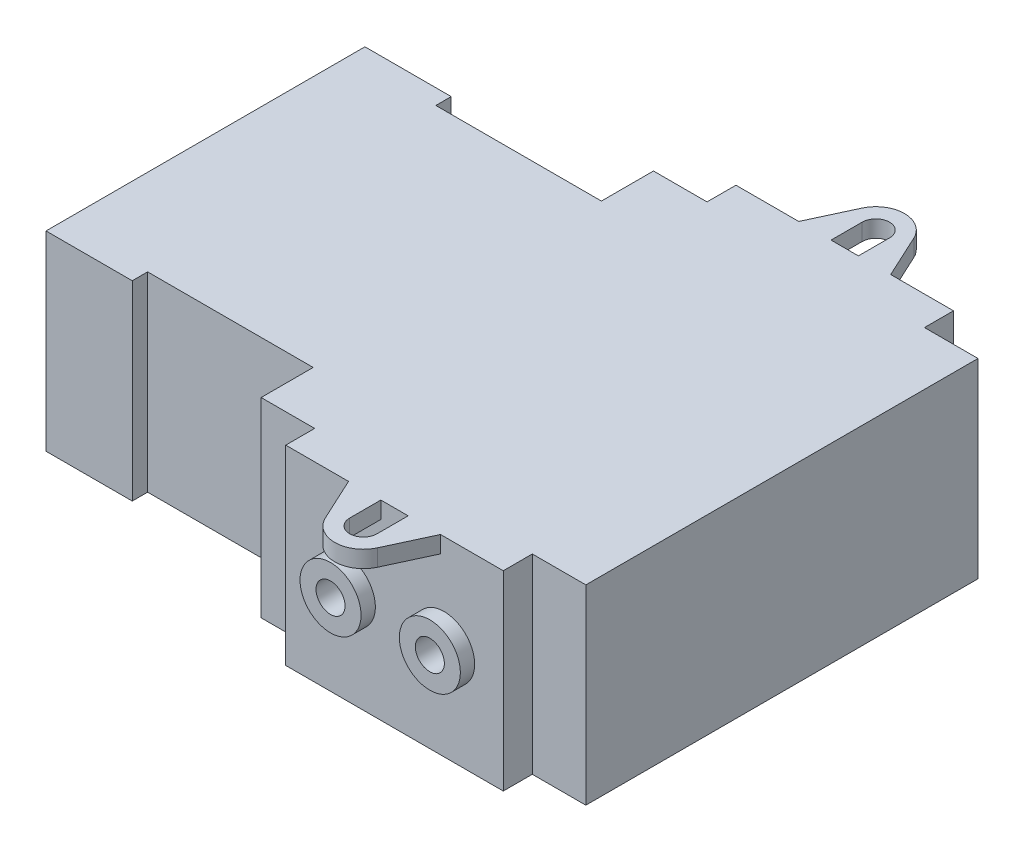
from build123d import *

# Parameters (mm, degrees)
BOSS_EXTRUDE1_DEPTH = 23.0378
SKETCH2_R           = 3.683
BOSS_EXTRUDE2_DEPTH = 1.7272
SKETCH3_R           = 1.7526
CUT_EXTRUDE1_DEPTH  = 72.299953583
BOSS_EXTRUDE3_DEPTH = 2.032


with BuildPart() as part:
    # Sketch1 → Boss-Extrude1 (new body)
    with BuildSketch(Plane(origin=(0, 0, 0), x_dir=(1, 0, 0), z_dir=(0, 1, 0))):
        Polygon((-34.798, 19.2532), (-24.384, 19.2532), (-24.384, 17.399), (-4.3942, 17.399), (-4.3942, 23.684705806), (2.0701, 23.684705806), (2.0701, 27.178), (28.3337, 27.178), (28.3337, 23.6728), (34.798, 23.6728), (34.798, -23.6728), (28.3337, -23.6728), (28.3337, -27.178), (2.0701, -27.178), (2.0701, -23.684705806), (-4.3942, -23.684705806), (-4.3942, -17.399), (-24.384, -17.399), (-24.384, -19.2532), (-34.798, -19.2532), align=None)
    extrude(amount=BOSS_EXTRUDE1_DEPTH)

    # Sketch2 → Boss-Extrude2 (add)
    with BuildSketch(Plane.XY.offset(27.178)):
        with Locations(Location((21.1963, 11.5189, 0), (0, 0, 180))):
            Circle(SKETCH2_R)
        with Locations(Location((9.2075, 11.5189, 0), (0, 0, 180))):
            Circle(SKETCH2_R)
    boss_extrude2 = extrude(amount=BOSS_EXTRUDE2_DEPTH)

    # Mirror1: Boss-Extrude2 across plane
    add(boss_extrude2.mirror(Plane.XY))

    # Sketch3 → Cut-Extrude1 (cut, through all)
    with BuildSketch(Plane.XY.offset(28.9052)):
        with Locations((21.1963, 11.5189)):
            Circle(SKETCH3_R)
        with Locations((9.2075, 11.5189)):
            Circle(SKETCH3_R)
    extrude(amount=-CUT_EXTRUDE1_DEPTH, mode=Mode.SUBTRACT)

    # Sketch4 → Boss-Extrude3 (add)
    with BuildSketch(Plane(origin=(0, 23.0378, 0), x_dir=(1, 0, 0), z_dir=(0, 1, 0))):
        with BuildLine():
            Line((13.5509, -27.178), (9.652, -27.178))
            Line((9.652, -27.178), (12.067809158, -32.389905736))
            ThreePointArc((12.067809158, -32.389905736), (15.2019, -34.3916), (18.335990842, -32.389905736))
            Line((18.335990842, -32.389905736), (20.7518, -27.178))
            Line((20.7518, -27.178), (16.8529, -27.178))
            Line((16.8529, -27.178), (16.8529, -30.9372))
            ThreePointArc((16.8529, -30.9372), (15.2019, -32.5882), (13.5509, -30.9372))
            Line((13.5509, -30.9372), (13.5509, -27.178))
        make_face()
        with BuildLine():
            Line((16.8529, 30.9372), (16.8529, 27.178))
            Line((16.8529, 27.178), (20.7518, 27.178))
            Line((20.7518, 27.178), (18.335990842, 32.389905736))
            ThreePointArc((18.335990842, 32.389905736), (15.2019, 34.3916), (12.067809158, 32.389905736))
            Line((12.067809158, 32.389905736), (9.652, 27.178))
            Line((9.652, 27.178), (13.5509, 27.178))
            Line((13.5509, 27.178), (13.5509, 30.9372))
            ThreePointArc((13.5509, 30.9372), (15.2019, 32.5882), (16.8529, 30.9372))
        make_face()
    extrude(amount=-BOSS_EXTRUDE3_DEPTH)


solid = part.part
